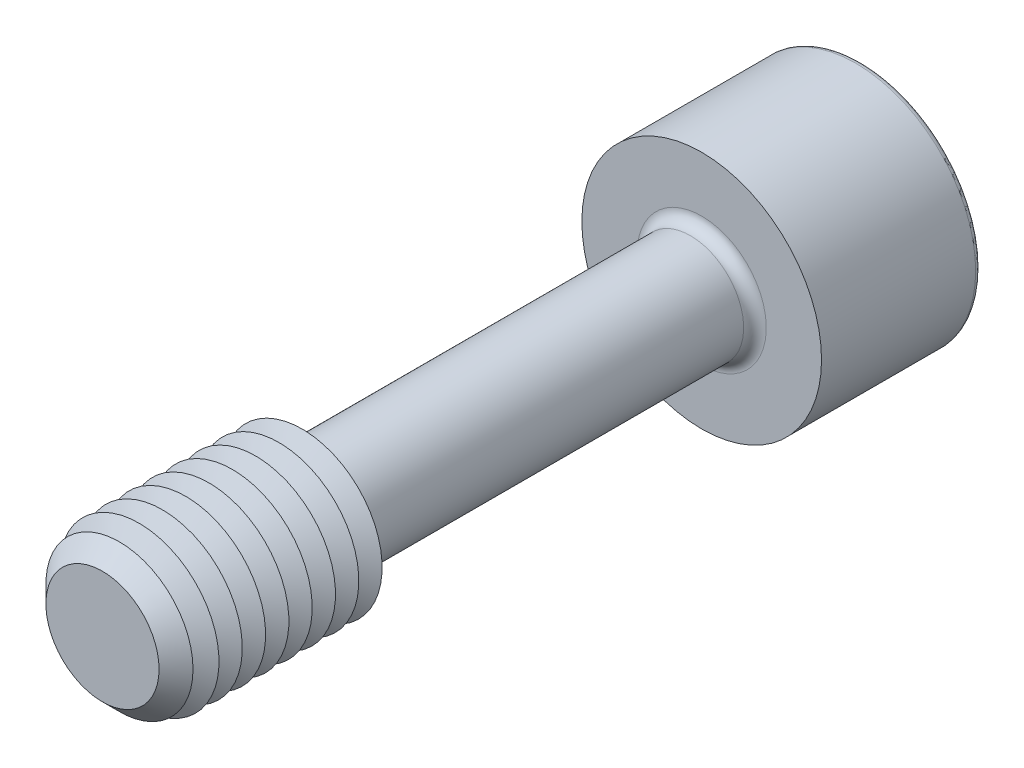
from build123d import *

# Parameters (mm, degrees)
SKETCH1_R       = 4
EXTRUDE1_DEPTH  = 22.5
CHAMFER1_SIZE   = 1.75
SKETCH3_R       = 9
EXTRUDE2_DEPTH  = 12
EXTRUDE3_DEPTH  = 10
FILLET1_R       = 0.85
FILLET2_R       = 0.425
LPATTERN1_COUNT = 8
LPATTERN1_PITCH = 1.75


with BuildPart() as part:
    # Sketch1 → Extrude1 (new, symmetric)
    with BuildSketch(Plane.XY):
        with Locations(Location((0, 0, 0), (0, 0, 180))):
            Circle(SKETCH1_R)
    extrude(amount=EXTRUDE1_DEPTH, both=True)

    # Sketch2 → Revolve1 (revolve)
    with BuildSketch(Plane(origin=(0, 0, 0), x_dir=(0, 0, -1), z_dir=(1, 0, 0)), mode=Mode.PRIVATE) as revolve1_sk:
        Polygon((-22.5, 0), (-22.5, 6), (-7.5, 6), (-6.345299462, 4), (-6.345299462, 0), align=None)
    revolve(revolve1_sk.sketch.rotate(Axis((0, 0, 6.345299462), (0, 0, 1)), 90), axis=Axis((0, 0, 6.345299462), (0, 0, 1)))

    # Chamfer1
    chamfer1_edges = [part.edges().sort_by_distance(p)[0] for p in [
        (6, 0, 22.5),
    ]]
    chamfer(chamfer1_edges, length=CHAMFER1_SIZE)

    # Sketch3 → Extrude2 (add)
    with BuildSketch(Plane(origin=(0, 0, -22.5), x_dir=(-1, 0, 0), z_dir=(0, 0, -1))):
        Circle(SKETCH3_R)
    extrude(amount=EXTRUDE2_DEPTH)

    # Sketch4 → Extrude3 (cut)
    with BuildSketch(Plane(origin=(-13.7, 0, -34.5), x_dir=(1, 0, 0), z_dir=(0, 0, 1))):
        Polygon((10.813248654, -5), (16.586751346, -5), (19.473502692, 0), (16.586751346, 5), (10.813248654, 5), (7.926497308, 0), align=None)
    extrude(amount=EXTRUDE3_DEPTH, mode=Mode.SUBTRACT)

    # Fillet1
    fillet1_edges = [part.edges().sort_by_distance(p)[0] for p in [
        (4, 0, -22.5),
    ]]
    fillet(fillet1_edges, radius=FILLET1_R)

    # Fillet2
    fillet2_edges = [part.edges().sort_by_distance(p)[0] for p in [
        (9, 0, -34.5),
    ]]
    fillet(fillet2_edges, radius=FILLET2_R)

    # Sketch5 → Cut-Revolve1 (revolve, cut)
    with BuildSketch(Plane(origin=(0, 0, 0), x_dir=(0, 0, -1), z_dir=(1, 0, 0)), mode=Mode.PRIVATE) as cut_revolve1_sk:
        Polygon((24.5, 0), (24.5, -5), (21.613248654, 0), align=None)
    revolve(cut_revolve1_sk.sketch.rotate(Axis((0, 0, -21.613248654), (0, 0, -1)), 180), axis=Axis((0, 0, -21.613248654), (0, 0, -1)), mode=Mode.SUBTRACT)

    # Sketch7 → Cut-Revolve2 (revolve, cut)
    with BuildSketch(Plane(origin=(0, 0, 0), x_dir=(0, 0, -1), z_dir=(1, 0, 0)), mode=Mode.PRIVATE) as cut_revolve2_sk:
        Polygon((-7.5, 6), (-8.375, 4.484455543), (-9.25, 6), align=None)
    cut_revolve2 = revolve(cut_revolve2_sk.sketch.rotate(Axis((0, 0, -1.332048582), (0, 0, 1)), 90), axis=Axis((0, 0, -1.332048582), (0, 0, 1)), mode=Mode.SUBTRACT)

    # LPattern1: Cut-Revolve2 ×8
    with Locations(*[(0, 0, i * LPATTERN1_PITCH) for i in range(1, LPATTERN1_COUNT)]):
        add(cut_revolve2, mode=Mode.SUBTRACT)


solid = part.part
